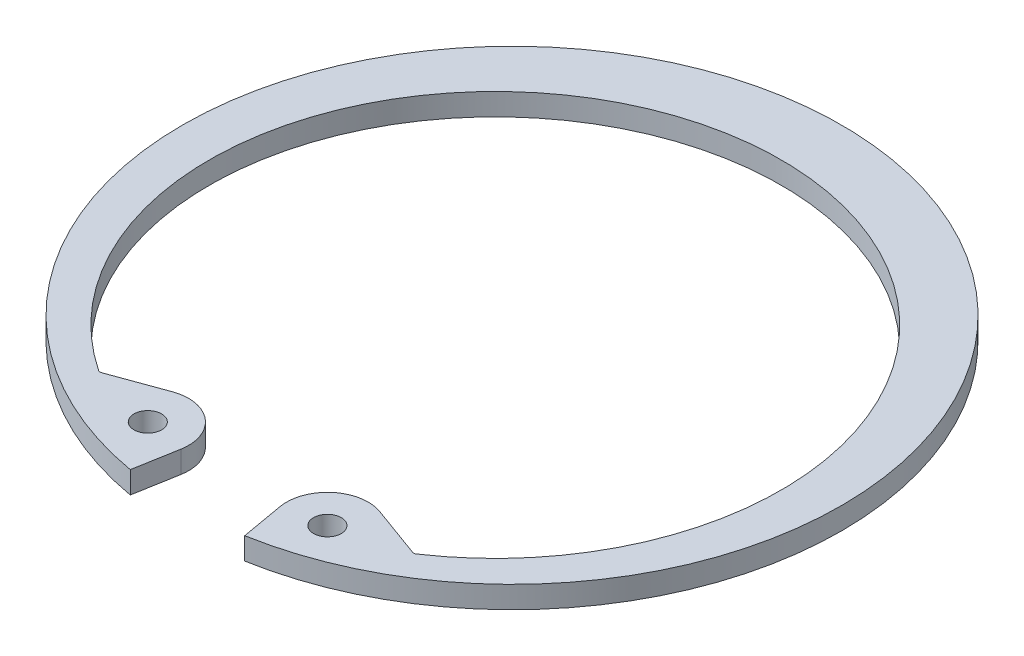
ISO-10303-21;
HEADER;
FILE_DESCRIPTION(('STEP AP214'),'2;1');
FILE_NAME('part.step','',(''),(''),'','','');
FILE_SCHEMA(('AUTOMOTIVE_DESIGN { 1 0 10303 214 1 1 1 1 }'));
ENDSEC;
DATA;
#1=APPLICATION_CONTEXT('core data for automotive mechanical design processes');
#2=APPLICATION_PROTOCOL_DEFINITION('international standard','automotive_design',2000,#1);
#3=PRODUCT_CONTEXT('',#1,'mechanical');
#4=PRODUCT('Part','Part','',(#3));
#5=PRODUCT_RELATED_PRODUCT_CATEGORY('part','',(#4));
#6=PRODUCT_DEFINITION_FORMATION('','',#4);
#7=PRODUCT_DEFINITION_CONTEXT('part definition',#1,'design');
#8=PRODUCT_DEFINITION('design','',#6,#7);
#9=PRODUCT_DEFINITION_SHAPE('','',#8);
#10=(LENGTH_UNIT() NAMED_UNIT(*) SI_UNIT(.MILLI.,.METRE.));
#11=(NAMED_UNIT(*) PLANE_ANGLE_UNIT() SI_UNIT($,.RADIAN.));
#12=(NAMED_UNIT(*) SI_UNIT($,.STERADIAN.) SOLID_ANGLE_UNIT());
#13=UNCERTAINTY_MEASURE_WITH_UNIT(LENGTH_MEASURE(1.E-05),#10,'distance_accuracy_value','');
#14=(GEOMETRIC_REPRESENTATION_CONTEXT(3) GLOBAL_UNCERTAINTY_ASSIGNED_CONTEXT((#13)) GLOBAL_UNIT_ASSIGNED_CONTEXT((#10,
#11,#12)) REPRESENTATION_CONTEXT('',''));
#15=CARTESIAN_POINT('',(0.,0.,0.));
#16=DIRECTION('',(0.,0.,1.));
#17=DIRECTION('',(1.,0.,0.));
#18=AXIS2_PLACEMENT_3D('',#15,#16,#17);
#19=CARTESIAN_POINT('',(6.43089324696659,-1.57479999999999,19.6500393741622));
#20=DIRECTION('',(0.,1.,0.));
#21=DIRECTION('',(0.,0.,1.));
#22=AXIS2_PLACEMENT_3D('',#19,#20,#21);
#23=CYLINDRICAL_SURFACE('',#22,2.921);
#24=CARTESIAN_POINT('',(6.43089324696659,0.,19.6500393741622));
#25=DIRECTION('',(0.,1.,0.));
#26=DIRECTION('',(0.,0.,-1.));
#27=AXIS2_PLACEMENT_3D('',#24,#25,#26);
#28=CIRCLE('',#27,2.921);
#29=CARTESIAN_POINT('',(7.42993408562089,0.,16.9051972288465));
#30=VERTEX_POINT('',#29);
#31=CARTESIAN_POINT('',(3.55426980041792,0.,20.1572657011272));
#32=VERTEX_POINT('',#31);
#33=EDGE_CURVE('E202',#30,#32,#28,.T.);
#34=ORIENTED_EDGE('',*,*,#33,.F.);
#35=DIRECTION('',(0.,1.,0.));
#36=VECTOR('',#35,1.);
#37=CARTESIAN_POINT('',(7.42993408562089,-1.57479999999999,16.9051972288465));
#38=LINE('',#37,#36);
#39=CARTESIAN_POINT('',(7.42993408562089,-1.57479999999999,16.9051972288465));
#40=VERTEX_POINT('',#39);
#41=EDGE_CURVE('E171',#40,#30,#38,.T.);
#42=ORIENTED_EDGE('',*,*,#41,.F.);
#43=CARTESIAN_POINT('',(6.43089324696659,-1.57479999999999,19.6500393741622));
#44=DIRECTION('',(0.,1.,0.));
#45=DIRECTION('',(0.,0.,-1.));
#46=AXIS2_PLACEMENT_3D('',#43,#44,#45);
#47=CIRCLE('',#46,2.921);
#48=CARTESIAN_POINT('',(3.55426980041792,-1.57479999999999,20.1572657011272));
#49=VERTEX_POINT('',#48);
#50=EDGE_CURVE('E163',#40,#49,#47,.T.);
#51=ORIENTED_EDGE('',*,*,#50,.T.);
#52=DIRECTION('',(0.,1.,0.));
#53=VECTOR('',#52,1.);
#54=CARTESIAN_POINT('',(3.55426980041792,-1.57479999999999,20.1572657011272));
#55=LINE('',#54,#53);
#56=EDGE_CURVE('E145',#49,#32,#55,.T.);
#57=ORIENTED_EDGE('',*,*,#56,.T.);
#58=EDGE_LOOP('',(#34,#42,#51,#57));
#59=FACE_BOUND('',#58,.T.);
#60=ADVANCED_FACE('F49',(#59),#23,.T.);
#61=CARTESIAN_POINT('',(11.2628461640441,-1.57479999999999,18.300263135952));
#62=DIRECTION('',(0.342020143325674,0.,-0.93969262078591));
#63=DIRECTION('',(-0.93969262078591,0.,-0.342020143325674));
#64=AXIS2_PLACEMENT_3D('',#61,#62,#63);
#65=PLANE('',#64);
#66=DIRECTION('',(-0.93969262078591,0.,-0.342020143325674));
#67=VECTOR('',#66,1.);
#68=CARTESIAN_POINT('',(11.2628461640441,0.,18.300263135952));
#69=LINE('',#68,#67);
#70=CARTESIAN_POINT('',(11.1424149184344,0.,18.2564297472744));
#71=VERTEX_POINT('',#70);
#72=EDGE_CURVE('E173',#71,#30,#69,.T.);
#73=ORIENTED_EDGE('',*,*,#72,.F.);
#74=DIRECTION('',(0.,-1.,0.));
#75=VECTOR('',#74,1.);
#76=CARTESIAN_POINT('',(11.1424149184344,-1.57479999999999,18.2564297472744));
#77=LINE('',#76,#75);
#78=CARTESIAN_POINT('',(11.1424149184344,-1.57479999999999,18.2564297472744));
#79=VERTEX_POINT('',#78);
#80=EDGE_CURVE('E68',#71,#79,#77,.T.);
#81=ORIENTED_EDGE('',*,*,#80,.T.);
#82=DIRECTION('',(-0.93969262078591,0.,-0.342020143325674));
#83=VECTOR('',#82,1.);
#84=CARTESIAN_POINT('',(11.2628461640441,-1.57479999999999,18.300263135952));
#85=LINE('',#84,#83);
#86=EDGE_CURVE('E157',#79,#40,#85,.T.);
#87=ORIENTED_EDGE('',*,*,#86,.T.);
#88=ORIENTED_EDGE('',*,*,#41,.T.);
#89=EDGE_LOOP('',(#73,#81,#87,#88));
#90=FACE_BOUND('',#89,.T.);
#91=ADVANCED_FACE('F286',(#90),#65,.T.);
#92=CARTESIAN_POINT('',(0.,-1.57479999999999,1.19863813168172));
#93=DIRECTION('',(0.,1.,0.));
#94=DIRECTION('',(0.,0.,1.));
#95=AXIS2_PLACEMENT_3D('',#92,#93,#94);
#96=CYLINDRICAL_SURFACE('',#95,20.4772381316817);
#97=CARTESIAN_POINT('',(0.,0.,1.19863813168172));
#98=DIRECTION('',(0.,-1.,0.));
#99=DIRECTION('',(0.,0.,1.));
#100=AXIS2_PLACEMENT_3D('',#97,#98,#99);
#101=CIRCLE('',#100,20.4772381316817);
#102=CARTESIAN_POINT('',(-11.3703257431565,0.,18.228992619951));
#103=VERTEX_POINT('',#102);
#104=CARTESIAN_POINT('',(11.3703257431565,0.,18.228992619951));
#105=VERTEX_POINT('',#104);
#106=EDGE_CURVE('E177',#103,#105,#101,.T.);
#107=ORIENTED_EDGE('',*,*,#106,.F.);
#108=DIRECTION('',(0.,1.,0.));
#109=VECTOR('',#108,1.);
#110=CARTESIAN_POINT('',(-11.3703257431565,-1.57479999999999,18.228992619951));
#111=LINE('',#110,#109);
#112=CARTESIAN_POINT('',(-11.3703257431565,-1.57479999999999,18.228992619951));
#113=VERTEX_POINT('',#112);
#114=EDGE_CURVE('E247',#103,#113,#111,.F.);
#115=ORIENTED_EDGE('',*,*,#114,.T.);
#116=CARTESIAN_POINT('',(0.,-1.57479999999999,1.19863813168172));
#117=DIRECTION('',(0.,-1.,0.));
#118=DIRECTION('',(0.,0.,1.));
#119=AXIS2_PLACEMENT_3D('',#116,#117,#118);
#120=CIRCLE('',#119,20.4772381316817);
#121=CARTESIAN_POINT('',(11.3703257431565,-1.57479999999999,18.228992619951));
#122=VERTEX_POINT('',#121);
#123=EDGE_CURVE('E196',#113,#122,#120,.T.);
#124=ORIENTED_EDGE('',*,*,#123,.T.);
#125=DIRECTION('',(0.,1.,0.));
#126=VECTOR('',#125,1.);
#127=CARTESIAN_POINT('',(11.3703257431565,-1.57479999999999,18.228992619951));
#128=LINE('',#127,#126);
#129=EDGE_CURVE('E243',#122,#105,#128,.T.);
#130=ORIENTED_EDGE('',*,*,#129,.T.);
#131=EDGE_LOOP('',(#107,#115,#124,#130));
#132=FACE_BOUND('',#131,.T.);
#133=ADVANCED_FACE('F293',(#132),#96,.F.);
#134=CARTESIAN_POINT('',(-11.2628461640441,-1.57479999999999,18.3002631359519));
#135=DIRECTION('',(-0.342020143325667,0.,-0.939692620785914));
#136=DIRECTION('',(-0.939692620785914,0.,0.342020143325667));
#137=AXIS2_PLACEMENT_3D('',#134,#135,#136);
#138=PLANE('',#137);
#139=DIRECTION('',(-0.939692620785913,0.,0.342020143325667));
#140=VECTOR('',#139,1.);
#141=CARTESIAN_POINT('',(-11.2628461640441,-1.57479999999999,18.3002631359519));
#142=LINE('',#141,#140);
#143=CARTESIAN_POINT('',(-7.42993408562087,-1.57479999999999,16.9051972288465));
#144=VERTEX_POINT('',#143);
#145=CARTESIAN_POINT('',(-11.1424149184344,-1.57479999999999,18.2564297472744));
#146=VERTEX_POINT('',#145);
#147=EDGE_CURVE('E192',#144,#146,#142,.T.);
#148=ORIENTED_EDGE('',*,*,#147,.T.);
#149=DIRECTION('',(0.,-1.,0.));
#150=VECTOR('',#149,1.);
#151=CARTESIAN_POINT('',(-11.1424149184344,0.,18.2564297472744));
#152=LINE('',#151,#150);
#153=CARTESIAN_POINT('',(-11.1424149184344,0.,18.2564297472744));
#154=VERTEX_POINT('',#153);
#155=EDGE_CURVE('E228',#146,#154,#152,.F.);
#156=ORIENTED_EDGE('',*,*,#155,.T.);
#157=DIRECTION('',(-0.939692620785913,0.,0.342020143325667));
#158=VECTOR('',#157,1.);
#159=CARTESIAN_POINT('',(-11.2628461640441,0.,18.3002631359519));
#160=LINE('',#159,#158);
#161=CARTESIAN_POINT('',(-7.42993408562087,0.,16.9051972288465));
#162=VERTEX_POINT('',#161);
#163=EDGE_CURVE('E220',#162,#154,#160,.T.);
#164=ORIENTED_EDGE('',*,*,#163,.F.);
#165=DIRECTION('',(0.,1.,0.));
#166=VECTOR('',#165,1.);
#167=CARTESIAN_POINT('',(-7.42993408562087,-1.57479999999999,16.9051972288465));
#168=LINE('',#167,#166);
#169=EDGE_CURVE('E229',#144,#162,#168,.T.);
#170=ORIENTED_EDGE('',*,*,#169,.F.);
#171=EDGE_LOOP('',(#148,#156,#164,#170));
#172=FACE_BOUND('',#171,.T.);
#173=ADVANCED_FACE('F301',(#172),#138,.T.);
#174=CARTESIAN_POINT('',(-6.43089324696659,-1.57479999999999,19.6500393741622));
#175=DIRECTION('',(0.,1.,0.));
#176=DIRECTION('',(0.,0.,1.));
#177=AXIS2_PLACEMENT_3D('',#174,#175,#176);
#178=CYLINDRICAL_SURFACE('',#177,2.921);
#179=CARTESIAN_POINT('',(-6.43089324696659,0.,19.6500393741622));
#180=DIRECTION('',(0.,1.,0.));
#181=DIRECTION('',(0.,0.,1.));
#182=AXIS2_PLACEMENT_3D('',#179,#180,#181);
#183=CIRCLE('',#182,2.921);
#184=CARTESIAN_POINT('',(-3.55426980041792,0.,20.1572657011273));
#185=VERTEX_POINT('',#184);
#186=EDGE_CURVE('E216',#185,#162,#183,.T.);
#187=ORIENTED_EDGE('',*,*,#186,.F.);
#188=DIRECTION('',(0.,1.,0.));
#189=VECTOR('',#188,1.);
#190=CARTESIAN_POINT('',(-3.55426980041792,-1.57479999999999,20.1572657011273));
#191=LINE('',#190,#189);
#192=CARTESIAN_POINT('',(-3.55426980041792,-1.57479999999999,20.1572657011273));
#193=VERTEX_POINT('',#192);
#194=EDGE_CURVE('E232',#193,#185,#191,.T.);
#195=ORIENTED_EDGE('',*,*,#194,.F.);
#196=CARTESIAN_POINT('',(-6.43089324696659,-1.57479999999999,19.6500393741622));
#197=DIRECTION('',(0.,1.,0.));
#198=DIRECTION('',(0.,0.,1.));
#199=AXIS2_PLACEMENT_3D('',#196,#197,#198);
#200=CIRCLE('',#199,2.921);
#201=EDGE_CURVE('E189',#193,#144,#200,.T.);
#202=ORIENTED_EDGE('',*,*,#201,.T.);
#203=ORIENTED_EDGE('',*,*,#169,.T.);
#204=EDGE_LOOP('',(#187,#195,#202,#203));
#205=FACE_BOUND('',#204,.T.);
#206=ADVANCED_FACE('F306',(#205),#178,.T.);
#207=CARTESIAN_POINT('',(-4.09750658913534,-1.57479999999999,23.238114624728));
#208=DIRECTION('',(0.984807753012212,0.,0.173648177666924));
#209=DIRECTION('',(0.173648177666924,0.,-0.984807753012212));
#210=AXIS2_PLACEMENT_3D('',#207,#208,#209);
#211=PLANE('',#210);
#212=DIRECTION('',(0.173648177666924,0.,-0.984807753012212));
#213=VECTOR('',#212,1.);
#214=CARTESIAN_POINT('',(-4.09750658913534,0.,23.238114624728));
#215=LINE('',#214,#213);
#216=CARTESIAN_POINT('',(-4.09750658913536,0.,23.238114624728));
#217=VERTEX_POINT('',#216);
#218=EDGE_CURVE('E212',#217,#185,#215,.T.);
#219=ORIENTED_EDGE('',*,*,#218,.F.);
#220=DIRECTION('',(0.,1.,0.));
#221=VECTOR('',#220,1.);
#222=CARTESIAN_POINT('',(-4.09750658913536,-1.57479999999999,23.238114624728));
#223=LINE('',#222,#221);
#224=CARTESIAN_POINT('',(-4.09750658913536,-1.57479999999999,23.238114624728));
#225=VERTEX_POINT('',#224);
#226=EDGE_CURVE('E235',#225,#217,#223,.T.);
#227=ORIENTED_EDGE('',*,*,#226,.F.);
#228=DIRECTION('',(0.173648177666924,0.,-0.984807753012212));
#229=VECTOR('',#228,1.);
#230=CARTESIAN_POINT('',(-4.09750658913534,-1.57479999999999,23.238114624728));
#231=LINE('',#230,#229);
#232=EDGE_CURVE('E185',#225,#193,#231,.T.);
#233=ORIENTED_EDGE('',*,*,#232,.T.);
#234=ORIENTED_EDGE('',*,*,#194,.T.);
#235=EDGE_LOOP('',(#219,#227,#233,#234));
#236=FACE_BOUND('',#235,.T.);
#237=ADVANCED_FACE('F309',(#236),#211,.T.);
#238=CARTESIAN_POINT('',(0.,-1.57479999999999,0.));
#239=DIRECTION('',(0.,1.,0.));
#240=DIRECTION('',(0.,0.,1.));
#241=AXIS2_PLACEMENT_3D('',#238,#239,#240);
#242=CYLINDRICAL_SURFACE('',#241,23.5966);
#243=CARTESIAN_POINT('',(0.,0.,0.));
#244=DIRECTION('',(0.,1.,0.));
#245=DIRECTION('',(0.,0.,1.));
#246=AXIS2_PLACEMENT_3D('',#243,#244,#245);
#247=CIRCLE('',#246,23.5966);
#248=CARTESIAN_POINT('',(4.09750658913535,0.,23.238114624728));
#249=VERTEX_POINT('',#248);
#250=EDGE_CURVE('E208',#249,#217,#247,.T.);
#251=ORIENTED_EDGE('',*,*,#250,.F.);
#252=DIRECTION('',(0.,1.,0.));
#253=VECTOR('',#252,1.);
#254=CARTESIAN_POINT('',(4.09750658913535,-1.57479999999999,23.238114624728));
#255=LINE('',#254,#253);
#256=CARTESIAN_POINT('',(4.09750658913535,-1.57479999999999,23.238114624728));
#257=VERTEX_POINT('',#256);
#258=EDGE_CURVE('E156',#257,#249,#255,.T.);
#259=ORIENTED_EDGE('',*,*,#258,.F.);
#260=CARTESIAN_POINT('',(0.,-1.57479999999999,0.));
#261=DIRECTION('',(0.,1.,0.));
#262=DIRECTION('',(0.,0.,1.));
#263=AXIS2_PLACEMENT_3D('',#260,#261,#262);
#264=CIRCLE('',#263,23.5966);
#265=EDGE_CURVE('E166',#257,#225,#264,.T.);
#266=ORIENTED_EDGE('',*,*,#265,.T.);
#267=ORIENTED_EDGE('',*,*,#226,.T.);
#268=EDGE_LOOP('',(#251,#259,#266,#267));
#269=FACE_BOUND('',#268,.T.);
#270=ADVANCED_FACE('F312',(#269),#242,.T.);
#271=CARTESIAN_POINT('',(4.09750658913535,-1.57479999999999,23.238114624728));
#272=DIRECTION('',(-0.984807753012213,0.,0.173648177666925));
#273=DIRECTION('',(0.173648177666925,0.,0.984807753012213));
#274=AXIS2_PLACEMENT_3D('',#271,#272,#273);
#275=PLANE('',#274);
#276=DIRECTION('',(0.173648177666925,0.,0.984807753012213));
#277=VECTOR('',#276,1.);
#278=CARTESIAN_POINT('',(4.09750658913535,0.,23.238114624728));
#279=LINE('',#278,#277);
#280=EDGE_CURVE('E150',#32,#249,#279,.T.);
#281=ORIENTED_EDGE('',*,*,#280,.F.);
#282=ORIENTED_EDGE('',*,*,#56,.F.);
#283=DIRECTION('',(0.173648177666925,0.,0.984807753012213));
#284=VECTOR('',#283,1.);
#285=CARTESIAN_POINT('',(4.09750658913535,-1.57479999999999,23.238114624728));
#286=LINE('',#285,#284);
#287=EDGE_CURVE('E148',#49,#257,#286,.T.);
#288=ORIENTED_EDGE('',*,*,#287,.T.);
#289=ORIENTED_EDGE('',*,*,#258,.T.);
#290=EDGE_LOOP('',(#281,#282,#288,#289));
#291=FACE_BOUND('',#290,.T.);
#292=ADVANCED_FACE('F147',(#291),#275,.T.);
#293=CARTESIAN_POINT('',(6.43089324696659,-1.57479999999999,19.6500393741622));
#294=DIRECTION('',(0.,-1.,0.));
#295=DIRECTION('',(0.,0.,-1.));
#296=AXIS2_PLACEMENT_3D('',#293,#294,#295);
#297=PLANE('',#296);
#298=CARTESIAN_POINT('',(-6.43089324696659,-1.57479999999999,19.6500393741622));
#299=DIRECTION('',(0.,1.,0.));
#300=DIRECTION('',(0.,0.,1.));
#301=AXIS2_PLACEMENT_3D('',#298,#299,#300);
#302=CIRCLE('',#301,0.990599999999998);
#303=CARTESIAN_POINT('',(-6.43089324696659,-1.57479999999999,20.6406393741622));
#304=VERTEX_POINT('',#303);
#305=EDGE_CURVE('E260',#304,#304,#302,.T.);
#306=ORIENTED_EDGE('',*,*,#305,.T.);
#307=EDGE_LOOP('',(#306));
#308=FACE_BOUND('',#307,.T.);
#309=CARTESIAN_POINT('',(6.43089324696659,-1.57479999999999,19.6500393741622));
#310=DIRECTION('',(0.,1.,0.));
#311=DIRECTION('',(0.,0.,1.));
#312=AXIS2_PLACEMENT_3D('',#309,#310,#311);
#313=CIRCLE('',#312,0.990599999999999);
#314=CARTESIAN_POINT('',(6.43089324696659,-1.57479999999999,20.6406393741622));
#315=VERTEX_POINT('',#314);
#316=EDGE_CURVE('E205',#315,#315,#313,.T.);
#317=ORIENTED_EDGE('',*,*,#316,.T.);
#318=EDGE_LOOP('',(#317));
#319=FACE_BOUND('',#318,.T.);
#320=ORIENTED_EDGE('',*,*,#50,.F.);
#321=ORIENTED_EDGE('',*,*,#86,.F.);
#322=CARTESIAN_POINT('',(11.2292880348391,-1.57479999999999,18.0177478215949));
#323=DIRECTION('',(0.,-1.,0.));
#324=DIRECTION('',(0.,0.,-1.));
#325=AXIS2_PLACEMENT_3D('',#322,#323,#324);
#326=CIRCLE('',#325,0.254);
#327=EDGE_CURVE('E11',#79,#122,#326,.F.);
#328=ORIENTED_EDGE('',*,*,#327,.T.);
#329=ORIENTED_EDGE('',*,*,#123,.F.);
#330=CARTESIAN_POINT('',(-11.2292880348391,-1.57479999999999,18.0177478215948));
#331=DIRECTION('',(0.,-1.,0.));
#332=DIRECTION('',(0.,0.,-1.));
#333=AXIS2_PLACEMENT_3D('',#330,#331,#332);
#334=CIRCLE('',#333,0.254);
#335=EDGE_CURVE('E255',#113,#146,#334,.F.);
#336=ORIENTED_EDGE('',*,*,#335,.T.);
#337=ORIENTED_EDGE('',*,*,#147,.F.);
#338=ORIENTED_EDGE('',*,*,#201,.F.);
#339=ORIENTED_EDGE('',*,*,#232,.F.);
#340=ORIENTED_EDGE('',*,*,#265,.F.);
#341=ORIENTED_EDGE('',*,*,#287,.F.);
#342=EDGE_LOOP('',(#320,#321,#328,#329,#336,#337,#338,#339,#340,#341));
#343=FACE_BOUND('',#342,.T.);
#344=ADVANCED_FACE('F162',(#308,#319,#343),#297,.T.);
#345=CARTESIAN_POINT('',(6.43089324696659,0.,19.6500393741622));
#346=DIRECTION('',(0.,-1.,0.));
#347=DIRECTION('',(0.,0.,-1.));
#348=AXIS2_PLACEMENT_3D('',#345,#346,#347);
#349=PLANE('',#348);
#350=CARTESIAN_POINT('',(-6.43089324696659,0.,19.6500393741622));
#351=DIRECTION('',(0.,1.,0.));
#352=DIRECTION('',(0.,0.,1.));
#353=AXIS2_PLACEMENT_3D('',#350,#351,#352);
#354=CIRCLE('',#353,0.990599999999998);
#355=CARTESIAN_POINT('',(-6.43089324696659,0.,20.6406393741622));
#356=VERTEX_POINT('',#355);
#357=EDGE_CURVE('E262',#356,#356,#354,.T.);
#358=ORIENTED_EDGE('',*,*,#357,.F.);
#359=EDGE_LOOP('',(#358));
#360=FACE_BOUND('',#359,.T.);
#361=CARTESIAN_POINT('',(6.43089324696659,0.,19.6500393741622));
#362=DIRECTION('',(0.,1.,0.));
#363=DIRECTION('',(0.,0.,1.));
#364=AXIS2_PLACEMENT_3D('',#361,#362,#363);
#365=CIRCLE('',#364,0.990599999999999);
#366=CARTESIAN_POINT('',(6.43089324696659,0.,20.6406393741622));
#367=VERTEX_POINT('',#366);
#368=EDGE_CURVE('E180',#367,#367,#365,.T.);
#369=ORIENTED_EDGE('',*,*,#368,.F.);
#370=EDGE_LOOP('',(#369));
#371=FACE_BOUND('',#370,.T.);
#372=ORIENTED_EDGE('',*,*,#33,.T.);
#373=ORIENTED_EDGE('',*,*,#280,.T.);
#374=ORIENTED_EDGE('',*,*,#250,.T.);
#375=ORIENTED_EDGE('',*,*,#218,.T.);
#376=ORIENTED_EDGE('',*,*,#186,.T.);
#377=ORIENTED_EDGE('',*,*,#163,.T.);
#378=CARTESIAN_POINT('',(-11.2292880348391,0.,18.0177478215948));
#379=DIRECTION('',(0.,-1.,0.));
#380=DIRECTION('',(0.,0.,-1.));
#381=AXIS2_PLACEMENT_3D('',#378,#379,#380);
#382=CIRCLE('',#381,0.254);
#383=EDGE_CURVE('E252',#154,#103,#382,.T.);
#384=ORIENTED_EDGE('',*,*,#383,.T.);
#385=ORIENTED_EDGE('',*,*,#106,.T.);
#386=CARTESIAN_POINT('',(11.2292880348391,0.,18.0177478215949));
#387=DIRECTION('',(0.,-1.,0.));
#388=DIRECTION('',(0.,0.,-1.));
#389=AXIS2_PLACEMENT_3D('',#386,#387,#388);
#390=CIRCLE('',#389,0.254);
#391=EDGE_CURVE('E58',#105,#71,#390,.T.);
#392=ORIENTED_EDGE('',*,*,#391,.T.);
#393=ORIENTED_EDGE('',*,*,#72,.T.);
#394=EDGE_LOOP('',(#372,#373,#374,#375,#376,#377,#384,#385,#392,#393));
#395=FACE_BOUND('',#394,.T.);
#396=ADVANCED_FACE('F279',(#360,#371,#395),#349,.F.);
#397=CARTESIAN_POINT('',(6.43089324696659,-1.57479999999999,19.6500393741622));
#398=DIRECTION('',(0.,1.,0.));
#399=DIRECTION('',(0.,0.,1.));
#400=AXIS2_PLACEMENT_3D('',#397,#398,#399);
#401=CYLINDRICAL_SURFACE('',#400,0.990599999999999);
#402=ORIENTED_EDGE('',*,*,#316,.F.);
#403=EDGE_LOOP('',(#402));
#404=FACE_BOUND('',#403,.T.);
#405=ORIENTED_EDGE('',*,*,#368,.T.);
#406=EDGE_LOOP('',(#405));
#407=FACE_BOUND('',#406,.T.);
#408=ADVANCED_FACE('F275',(#404,#407),#401,.F.);
#409=CARTESIAN_POINT('',(-6.43089324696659,-1.57479999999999,19.6500393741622));
#410=DIRECTION('',(0.,1.,0.));
#411=DIRECTION('',(0.,0.,1.));
#412=AXIS2_PLACEMENT_3D('',#409,#410,#411);
#413=CYLINDRICAL_SURFACE('',#412,0.990599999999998);
#414=ORIENTED_EDGE('',*,*,#305,.F.);
#415=EDGE_LOOP('',(#414));
#416=FACE_BOUND('',#415,.T.);
#417=ORIENTED_EDGE('',*,*,#357,.T.);
#418=EDGE_LOOP('',(#417));
#419=FACE_BOUND('',#418,.T.);
#420=ADVANCED_FACE('F278',(#416,#419),#413,.F.);
#421=CARTESIAN_POINT('',(-11.2292880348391,-1.57479999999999,18.0177478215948));
#422=DIRECTION('',(0.,1.,0.));
#423=DIRECTION('',(0.,0.,1.));
#424=AXIS2_PLACEMENT_3D('',#421,#422,#423);
#425=CYLINDRICAL_SURFACE('',#424,0.254);
#426=ORIENTED_EDGE('',*,*,#335,.F.);
#427=ORIENTED_EDGE('',*,*,#114,.F.);
#428=ORIENTED_EDGE('',*,*,#383,.F.);
#429=ORIENTED_EDGE('',*,*,#155,.F.);
#430=EDGE_LOOP('',(#426,#427,#428,#429));
#431=FACE_BOUND('',#430,.T.);
#432=ADVANCED_FACE('F299',(#431),#425,.F.);
#433=CARTESIAN_POINT('',(11.2292880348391,-1.57479999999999,18.0177478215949));
#434=DIRECTION('',(0.,1.,0.));
#435=DIRECTION('',(0.,0.,1.));
#436=AXIS2_PLACEMENT_3D('',#433,#434,#435);
#437=CYLINDRICAL_SURFACE('',#436,0.254);
#438=ORIENTED_EDGE('',*,*,#327,.F.);
#439=ORIENTED_EDGE('',*,*,#80,.F.);
#440=ORIENTED_EDGE('',*,*,#391,.F.);
#441=ORIENTED_EDGE('',*,*,#129,.F.);
#442=EDGE_LOOP('',(#438,#439,#440,#441));
#443=FACE_BOUND('',#442,.T.);
#444=ADVANCED_FACE('F51',(#443),#437,.F.);
#445=CLOSED_SHELL('',(#60,#91,#133,#173,#206,#237,#270,#292,#344,#396,#408,#420,#432,#444));
#446=MANIFOLD_SOLID_BREP('B2',#445);
#447=ADVANCED_BREP_SHAPE_REPRESENTATION('',(#18,#446),#14);
#448=SHAPE_DEFINITION_REPRESENTATION(#9,#447);
ENDSEC;
END-ISO-10303-21;
